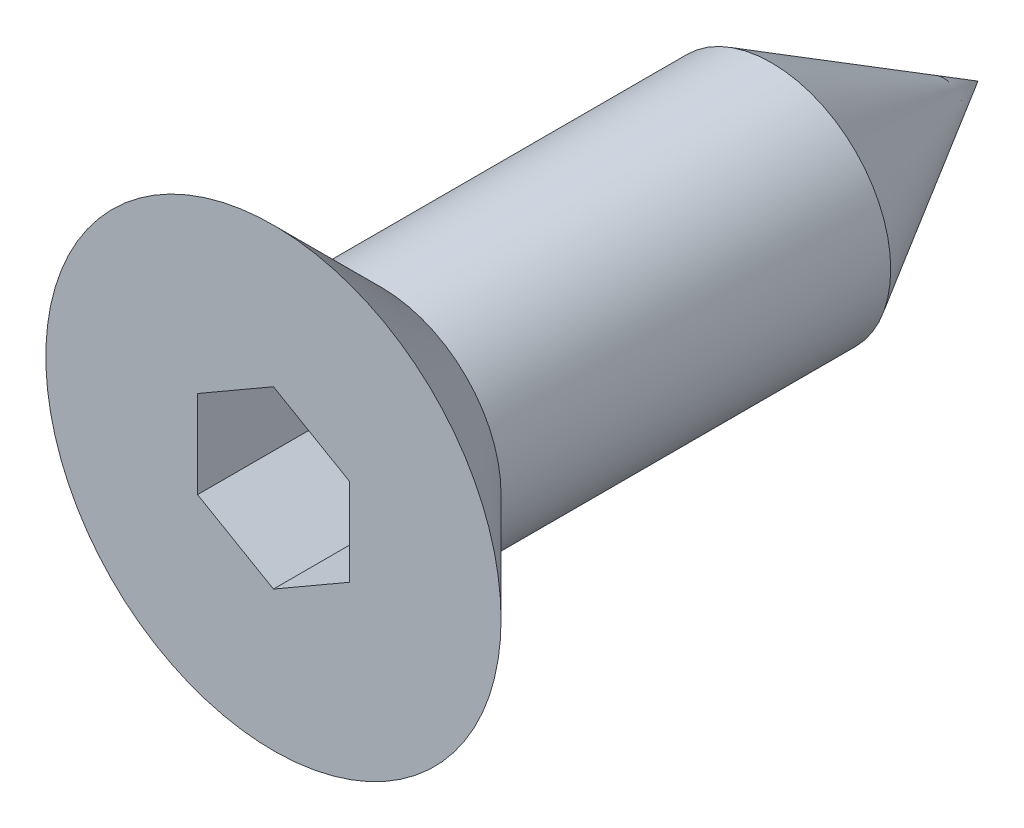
ISO-10303-21;
HEADER;
FILE_DESCRIPTION(('STEP AP214'),'2;1');
FILE_NAME('part.step','',(''),(''),'','','');
FILE_SCHEMA(('AUTOMOTIVE_DESIGN { 1 0 10303 214 1 1 1 1 }'));
ENDSEC;
DATA;
#1=APPLICATION_CONTEXT('core data for automotive mechanical design processes');
#2=APPLICATION_PROTOCOL_DEFINITION('international standard','automotive_design',2000,#1);
#3=PRODUCT_CONTEXT('',#1,'mechanical');
#4=PRODUCT('Part','Part','',(#3));
#5=PRODUCT_RELATED_PRODUCT_CATEGORY('part','',(#4));
#6=PRODUCT_DEFINITION_FORMATION('','',#4);
#7=PRODUCT_DEFINITION_CONTEXT('part definition',#1,'design');
#8=PRODUCT_DEFINITION('design','',#6,#7);
#9=PRODUCT_DEFINITION_SHAPE('','',#8);
#10=(LENGTH_UNIT() NAMED_UNIT(*) SI_UNIT(.MILLI.,.METRE.));
#11=(NAMED_UNIT(*) PLANE_ANGLE_UNIT() SI_UNIT($,.RADIAN.));
#12=(NAMED_UNIT(*) SI_UNIT($,.STERADIAN.) SOLID_ANGLE_UNIT());
#13=UNCERTAINTY_MEASURE_WITH_UNIT(LENGTH_MEASURE(1.E-05),#10,'distance_accuracy_value','');
#14=(GEOMETRIC_REPRESENTATION_CONTEXT(3) GLOBAL_UNCERTAINTY_ASSIGNED_CONTEXT((#13)) GLOBAL_UNIT_ASSIGNED_CONTEXT((#10,
#11,#12)) REPRESENTATION_CONTEXT('',''));
#15=CARTESIAN_POINT('',(0.,0.,0.));
#16=DIRECTION('',(0.,0.,1.));
#17=DIRECTION('',(1.,0.,0.));
#18=AXIS2_PLACEMENT_3D('',#15,#16,#17);
#19=CARTESIAN_POINT('',(0.,2.1,0.));
#20=DIRECTION('',(0.,0.,-1.));
#21=DIRECTION('',(-1.,0.,0.));
#22=AXIS2_PLACEMENT_3D('',#19,#20,#21);
#23=PLANE('',#22);
#24=DIRECTION('',(-0.866025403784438,-0.5,0.));
#25=VECTOR('',#24,1.);
#26=CARTESIAN_POINT('',(0.,0.808290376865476,0.));
#27=LINE('',#26,#25);
#28=CARTESIAN_POINT('',(0.,0.808290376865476,0.));
#29=VERTEX_POINT('',#28);
#30=CARTESIAN_POINT('',(-0.7,0.404145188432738,0.));
#31=VERTEX_POINT('',#30);
#32=EDGE_CURVE('E123',#29,#31,#27,.T.);
#33=ORIENTED_EDGE('',*,*,#32,.F.);
#34=DIRECTION('',(-0.866025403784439,0.5,0.));
#35=VECTOR('',#34,1.);
#36=CARTESIAN_POINT('',(0.699999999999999,0.404145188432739,0.));
#37=LINE('',#36,#35);
#38=CARTESIAN_POINT('',(0.699999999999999,0.404145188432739,0.));
#39=VERTEX_POINT('',#38);
#40=EDGE_CURVE('E53',#39,#29,#37,.T.);
#41=ORIENTED_EDGE('',*,*,#40,.F.);
#42=DIRECTION('',(0.,1.,0.));
#43=VECTOR('',#42,1.);
#44=CARTESIAN_POINT('',(0.7,-0.404145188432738,0.));
#45=LINE('',#44,#43);
#46=CARTESIAN_POINT('',(0.7,-0.404145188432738,0.));
#47=VERTEX_POINT('',#46);
#48=EDGE_CURVE('E109',#47,#39,#45,.T.);
#49=ORIENTED_EDGE('',*,*,#48,.F.);
#50=DIRECTION('',(0.866025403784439,0.5,0.));
#51=VECTOR('',#50,1.);
#52=CARTESIAN_POINT('',(0.,-0.808290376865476,0.));
#53=LINE('',#52,#51);
#54=CARTESIAN_POINT('',(0.,-0.808290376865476,0.));
#55=VERTEX_POINT('',#54);
#56=EDGE_CURVE('E112',#55,#47,#53,.T.);
#57=ORIENTED_EDGE('',*,*,#56,.F.);
#58=DIRECTION('',(0.866025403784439,-0.5,0.));
#59=VECTOR('',#58,1.);
#60=CARTESIAN_POINT('',(-0.7,-0.404145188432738,0.));
#61=LINE('',#60,#59);
#62=CARTESIAN_POINT('',(-0.7,-0.404145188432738,0.));
#63=VERTEX_POINT('',#62);
#64=EDGE_CURVE('E128',#63,#55,#61,.T.);
#65=ORIENTED_EDGE('',*,*,#64,.F.);
#66=DIRECTION('',(0.,-1.,0.));
#67=VECTOR('',#66,1.);
#68=CARTESIAN_POINT('',(-0.7,0.404145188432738,0.));
#69=LINE('',#68,#67);
#70=EDGE_CURVE('E125',#31,#63,#69,.T.);
#71=ORIENTED_EDGE('',*,*,#70,.F.);
#72=EDGE_LOOP('',(#33,#41,#49,#57,#65,#71));
#73=FACE_BOUND('',#72,.T.);
#74=CARTESIAN_POINT('',(0.,0.,0.));
#75=DIRECTION('',(0.,0.,1.));
#76=DIRECTION('',(1.,0.,0.));
#77=AXIS2_PLACEMENT_3D('',#74,#75,#76);
#78=CIRCLE('',#77,2.1);
#79=CARTESIAN_POINT('',(2.1,0.,0.));
#80=VERTEX_POINT('',#79);
#81=EDGE_CURVE('E46',#80,#80,#78,.T.);
#82=ORIENTED_EDGE('',*,*,#81,.T.);
#83=EDGE_LOOP('',(#82));
#84=FACE_BOUND('',#83,.T.);
#85=ADVANCED_FACE('F37',(#73,#84),#23,.F.);
#86=CARTESIAN_POINT('',(0.,0.,-1.));
#87=DIRECTION('',(0.,0.,1.));
#88=DIRECTION('',(1.,0.,0.));
#89=AXIS2_PLACEMENT_3D('',#86,#87,#88);
#90=CONICAL_SURFACE('',#89,1.1,0.785398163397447);
#91=ORIENTED_EDGE('',*,*,#81,.F.);
#92=EDGE_LOOP('',(#91));
#93=FACE_BOUND('',#92,.T.);
#94=CARTESIAN_POINT('',(0.,0.,-1.));
#95=DIRECTION('',(0.,0.,1.));
#96=DIRECTION('',(1.,0.,0.));
#97=AXIS2_PLACEMENT_3D('',#94,#95,#96);
#98=CIRCLE('',#97,1.1);
#99=CARTESIAN_POINT('',(1.1,0.,-1.));
#100=VERTEX_POINT('',#99);
#101=EDGE_CURVE('E135',#100,#100,#98,.T.);
#102=ORIENTED_EDGE('',*,*,#101,.T.);
#103=EDGE_LOOP('',(#102));
#104=FACE_BOUND('',#103,.T.);
#105=ADVANCED_FACE('F148',(#93,#104),#90,.T.);
#106=CARTESIAN_POINT('',(0.,0.,-6.5));
#107=DIRECTION('',(0.,0.,1.));
#108=DIRECTION('',(1.,0.,0.));
#109=AXIS2_PLACEMENT_3D('',#106,#107,#108);
#110=CYLINDRICAL_SURFACE('',#109,1.1);
#111=CARTESIAN_POINT('',(0.,0.,-4.59474411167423));
#112=DIRECTION('',(0.,0.,1.));
#113=DIRECTION('',(1.,0.,0.));
#114=AXIS2_PLACEMENT_3D('',#111,#112,#113);
#115=CIRCLE('',#114,1.1);
#116=CARTESIAN_POINT('',(1.1,0.,-4.59474411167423));
#117=VERTEX_POINT('',#116);
#118=EDGE_CURVE('E11',#117,#117,#115,.T.);
#119=CARTESIAN_POINT('',(1.1,0.,-4.59474411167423));
#120=CARTESIAN_POINT('',(1.1,0.,-4.55729886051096));
#121=CARTESIAN_POINT('',(1.1,0.,-4.51985360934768));
#122=CARTESIAN_POINT('',(1.1,0.,-4.44496310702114));
#123=CARTESIAN_POINT('',(1.1,0.,-4.40751785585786));
#124=CARTESIAN_POINT('',(1.1,0.,-4.33262735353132));
#125=CARTESIAN_POINT('',(1.1,0.,-4.29518210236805));
#126=CARTESIAN_POINT('',(1.1,0.,-4.2202916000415));
#127=CARTESIAN_POINT('',(1.1,0.,-4.18284634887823));
#128=CARTESIAN_POINT('',(1.1,0.,-4.10795584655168));
#129=CARTESIAN_POINT('',(1.1,0.,-4.07051059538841));
#130=CARTESIAN_POINT('',(1.1,0.,-3.99562009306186));
#131=CARTESIAN_POINT('',(1.1,0.,-3.95817484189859));
#132=CARTESIAN_POINT('',(1.1,0.,-3.88328433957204));
#133=CARTESIAN_POINT('',(1.1,0.,-3.84583908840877));
#134=CARTESIAN_POINT('',(1.1,0.,-3.77094858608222));
#135=CARTESIAN_POINT('',(1.1,0.,-3.73350333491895));
#136=CARTESIAN_POINT('',(1.1,0.,-3.6586128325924));
#137=CARTESIAN_POINT('',(1.1,0.,-3.62116758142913));
#138=CARTESIAN_POINT('',(1.1,0.,-3.54627707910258));
#139=CARTESIAN_POINT('',(1.1,0.,-3.50883182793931));
#140=CARTESIAN_POINT('',(1.1,0.,-3.43394132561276));
#141=CARTESIAN_POINT('',(1.1,0.,-3.39649607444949));
#142=CARTESIAN_POINT('',(1.1,0.,-3.32160557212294));
#143=CARTESIAN_POINT('',(1.1,0.,-3.28416032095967));
#144=CARTESIAN_POINT('',(1.1,0.,-3.20926981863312));
#145=CARTESIAN_POINT('',(1.1,0.,-3.17182456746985));
#146=CARTESIAN_POINT('',(1.1,0.,-3.0969340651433));
#147=CARTESIAN_POINT('',(1.1,0.,-3.05948881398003));
#148=CARTESIAN_POINT('',(1.1,0.,-2.98459831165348));
#149=CARTESIAN_POINT('',(1.1,0.,-2.94715306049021));
#150=CARTESIAN_POINT('',(1.1,0.,-2.87226255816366));
#151=CARTESIAN_POINT('',(1.1,0.,-2.83481730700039));
#152=CARTESIAN_POINT('',(1.1,0.,-2.75992680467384));
#153=CARTESIAN_POINT('',(1.1,0.,-2.72248155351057));
#154=CARTESIAN_POINT('',(1.1,0.,-2.64759105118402));
#155=CARTESIAN_POINT('',(1.1,0.,-2.61014580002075));
#156=CARTESIAN_POINT('',(1.1,0.,-2.5352552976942));
#157=CARTESIAN_POINT('',(1.1,0.,-2.49781004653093));
#158=CARTESIAN_POINT('',(1.1,0.,-2.42291954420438));
#159=CARTESIAN_POINT('',(1.1,0.,-2.38547429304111));
#160=CARTESIAN_POINT('',(1.1,0.,-2.31058379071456));
#161=CARTESIAN_POINT('',(1.1,0.,-2.27313853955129));
#162=CARTESIAN_POINT('',(1.1,0.,-2.19824803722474));
#163=CARTESIAN_POINT('',(1.1,0.,-2.16080278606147));
#164=CARTESIAN_POINT('',(1.1,0.,-2.08591228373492));
#165=CARTESIAN_POINT('',(1.1,0.,-2.04846703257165));
#166=CARTESIAN_POINT('',(1.1,0.,-1.97357653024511));
#167=CARTESIAN_POINT('',(1.1,0.,-1.93613127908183));
#168=CARTESIAN_POINT('',(1.1,0.,-1.86124077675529));
#169=CARTESIAN_POINT('',(1.1,0.,-1.82379552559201));
#170=CARTESIAN_POINT('',(1.1,0.,-1.74890502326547));
#171=CARTESIAN_POINT('',(1.1,0.,-1.71145977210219));
#172=CARTESIAN_POINT('',(1.1,0.,-1.63656926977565));
#173=CARTESIAN_POINT('',(1.1,0.,-1.59912401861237));
#174=CARTESIAN_POINT('',(1.1,0.,-1.52423351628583));
#175=CARTESIAN_POINT('',(1.1,0.,-1.48678826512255));
#176=CARTESIAN_POINT('',(1.1,0.,-1.41189776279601));
#177=CARTESIAN_POINT('',(1.1,0.,-1.37445251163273));
#178=CARTESIAN_POINT('',(1.1,0.,-1.29956200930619));
#179=CARTESIAN_POINT('',(1.1,0.,-1.26211675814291));
#180=CARTESIAN_POINT('',(1.1,0.,-1.18722625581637));
#181=CARTESIAN_POINT('',(1.1,0.,-1.14978100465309));
#182=CARTESIAN_POINT('',(1.1,0.,-1.07489050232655));
#183=CARTESIAN_POINT('',(1.1,0.,-1.03744525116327));
#184=CARTESIAN_POINT('',(1.1,0.,-1.));
#185=B_SPLINE_CURVE_WITH_KNOTS('',3,(#119,#120,#121,#122,#123,#124,#125,#126,#127,#128,#129,
#130,#131,#132,#133,#134,#135,#136,#137,#138,#139,#140,#141,#142,#143,#144,#145,#146,#147,#148,
#149,#150,#151,#152,#153,#154,#155,#156,#157,#158,#159,#160,#161,#162,#163,#164,#165,#166,#167,
#168,#169,#170,#171,#172,#173,#174,#175,#176,#177,#178,#179,#180,#181,#182,#183,#184),
.UNSPECIFIED.,.F.,.F.,(4,2,2,2,2,2,2,2,2,2,2,2,2,2,2,2,2,2,2,2,2,2,2,2,2,2,2,2,2,2,2,2,4),(0.,
0.11233575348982,0.224671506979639,0.337007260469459,0.449343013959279,0.561678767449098,
0.674014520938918,0.786350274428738,0.898686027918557,1.01102178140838,1.1233575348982,
1.23569328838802,1.34802904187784,1.46036479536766,1.57270054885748,1.6850363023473,
1.79737205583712,1.90970780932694,2.02204356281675,2.13437931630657,2.24671506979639,
2.35905082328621,2.47138657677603,2.58372233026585,2.69605808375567,2.80839383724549,
2.92072959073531,3.03306534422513,3.14540109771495,3.25773685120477,3.37007260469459,
3.48240835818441,3.59474411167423),.UNSPECIFIED.);
#186=EDGE_CURVE('BSEAM151',#117,#100,#185,.T.);
#187=ORIENTED_EDGE('',*,*,#118,.T.);
#188=ORIENTED_EDGE('',*,*,#101,.F.);
#189=ORIENTED_EDGE('',*,*,#186,.T.);
#190=ORIENTED_EDGE('',*,*,#186,.F.);
#191=EDGE_LOOP('',(#187,#189,#188,#190));
#192=FACE_BOUND('',#191,.T.);
#193=ADVANCED_FACE('F151',(#192),#110,.T.);
#194=CARTESIAN_POINT('',(0.699999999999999,0.404145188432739,-1.5));
#195=DIRECTION('',(0.5,0.866025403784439,0.));
#196=DIRECTION('',(-0.866025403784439,0.5,0.));
#197=AXIS2_PLACEMENT_3D('',#194,#195,#196);
#198=PLANE('',#197);
#199=ORIENTED_EDGE('',*,*,#40,.T.);
#200=DIRECTION('',(0.,0.,1.));
#201=VECTOR('',#200,1.);
#202=CARTESIAN_POINT('',(0.,0.808290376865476,-1.5));
#203=LINE('',#202,#201);
#204=CARTESIAN_POINT('',(0.,0.808290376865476,-1.5));
#205=VERTEX_POINT('',#204);
#206=EDGE_CURVE('E86',#205,#29,#203,.T.);
#207=ORIENTED_EDGE('',*,*,#206,.F.);
#208=DIRECTION('',(-0.866025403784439,0.5,0.));
#209=VECTOR('',#208,1.);
#210=CARTESIAN_POINT('',(0.699999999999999,0.404145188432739,-1.5));
#211=LINE('',#210,#209);
#212=CARTESIAN_POINT('',(0.699999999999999,0.404145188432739,-1.5));
#213=VERTEX_POINT('',#212);
#214=EDGE_CURVE('E90',#213,#205,#211,.T.);
#215=ORIENTED_EDGE('',*,*,#214,.F.);
#216=DIRECTION('',(0.,0.,1.));
#217=VECTOR('',#216,1.);
#218=CARTESIAN_POINT('',(0.699999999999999,0.404145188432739,-1.5));
#219=LINE('',#218,#217);
#220=EDGE_CURVE('E133',#213,#39,#219,.T.);
#221=ORIENTED_EDGE('',*,*,#220,.T.);
#222=EDGE_LOOP('',(#199,#207,#215,#221));
#223=FACE_BOUND('',#222,.T.);
#224=ADVANCED_FACE('F88',(#223),#198,.F.);
#225=CARTESIAN_POINT('',(0.7,-0.404145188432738,-1.5));
#226=DIRECTION('',(1.,0.,0.));
#227=DIRECTION('',(0.,1.,0.));
#228=AXIS2_PLACEMENT_3D('',#225,#226,#227);
#229=PLANE('',#228);
#230=ORIENTED_EDGE('',*,*,#48,.T.);
#231=ORIENTED_EDGE('',*,*,#220,.F.);
#232=DIRECTION('',(0.,1.,0.));
#233=VECTOR('',#232,1.);
#234=CARTESIAN_POINT('',(0.7,-0.404145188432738,-1.5));
#235=LINE('',#234,#233);
#236=CARTESIAN_POINT('',(0.7,-0.404145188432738,-1.5));
#237=VERTEX_POINT('',#236);
#238=EDGE_CURVE('E96',#237,#213,#235,.T.);
#239=ORIENTED_EDGE('',*,*,#238,.F.);
#240=DIRECTION('',(0.,0.,1.));
#241=VECTOR('',#240,1.);
#242=CARTESIAN_POINT('',(0.7,-0.404145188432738,-1.5));
#243=LINE('',#242,#241);
#244=EDGE_CURVE('E136',#237,#47,#243,.T.);
#245=ORIENTED_EDGE('',*,*,#244,.T.);
#246=EDGE_LOOP('',(#230,#231,#239,#245));
#247=FACE_BOUND('',#246,.T.);
#248=ADVANCED_FACE('F161',(#247),#229,.F.);
#249=CARTESIAN_POINT('',(0.,-0.808290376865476,-1.5));
#250=DIRECTION('',(0.5,-0.866025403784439,0.));
#251=DIRECTION('',(0.866025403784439,0.5,0.));
#252=AXIS2_PLACEMENT_3D('',#249,#250,#251);
#253=PLANE('',#252);
#254=ORIENTED_EDGE('',*,*,#56,.T.);
#255=ORIENTED_EDGE('',*,*,#244,.F.);
#256=DIRECTION('',(0.866025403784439,0.5,0.));
#257=VECTOR('',#256,1.);
#258=CARTESIAN_POINT('',(0.,-0.808290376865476,-1.5));
#259=LINE('',#258,#257);
#260=CARTESIAN_POINT('',(0.,-0.808290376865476,-1.5));
#261=VERTEX_POINT('',#260);
#262=EDGE_CURVE('E119',#261,#237,#259,.T.);
#263=ORIENTED_EDGE('',*,*,#262,.F.);
#264=DIRECTION('',(0.,0.,1.));
#265=VECTOR('',#264,1.);
#266=CARTESIAN_POINT('',(0.,-0.808290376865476,-1.5));
#267=LINE('',#266,#265);
#268=EDGE_CURVE('E138',#261,#55,#267,.T.);
#269=ORIENTED_EDGE('',*,*,#268,.T.);
#270=EDGE_LOOP('',(#254,#255,#263,#269));
#271=FACE_BOUND('',#270,.T.);
#272=ADVANCED_FACE('F178',(#271),#253,.F.);
#273=CARTESIAN_POINT('',(-0.7,-0.404145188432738,-1.5));
#274=DIRECTION('',(-0.5,-0.866025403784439,0.));
#275=DIRECTION('',(0.866025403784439,-0.5,0.));
#276=AXIS2_PLACEMENT_3D('',#273,#274,#275);
#277=PLANE('',#276);
#278=ORIENTED_EDGE('',*,*,#64,.T.);
#279=ORIENTED_EDGE('',*,*,#268,.F.);
#280=DIRECTION('',(0.866025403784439,-0.5,0.));
#281=VECTOR('',#280,1.);
#282=CARTESIAN_POINT('',(-0.7,-0.404145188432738,-1.5));
#283=LINE('',#282,#281);
#284=CARTESIAN_POINT('',(-0.7,-0.404145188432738,-1.5));
#285=VERTEX_POINT('',#284);
#286=EDGE_CURVE('E116',#285,#261,#283,.T.);
#287=ORIENTED_EDGE('',*,*,#286,.F.);
#288=DIRECTION('',(0.,0.,1.));
#289=VECTOR('',#288,1.);
#290=CARTESIAN_POINT('',(-0.7,-0.404145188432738,-1.5));
#291=LINE('',#290,#289);
#292=EDGE_CURVE('E140',#285,#63,#291,.T.);
#293=ORIENTED_EDGE('',*,*,#292,.T.);
#294=EDGE_LOOP('',(#278,#279,#287,#293));
#295=FACE_BOUND('',#294,.T.);
#296=ADVANCED_FACE('F176',(#295),#277,.F.);
#297=CARTESIAN_POINT('',(-0.7,0.404145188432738,-1.5));
#298=DIRECTION('',(-1.,0.,0.));
#299=DIRECTION('',(0.,-1.,0.));
#300=AXIS2_PLACEMENT_3D('',#297,#298,#299);
#301=PLANE('',#300);
#302=ORIENTED_EDGE('',*,*,#70,.T.);
#303=ORIENTED_EDGE('',*,*,#292,.F.);
#304=DIRECTION('',(0.,-1.,0.));
#305=VECTOR('',#304,1.);
#306=CARTESIAN_POINT('',(-0.7,0.404145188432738,-1.5));
#307=LINE('',#306,#305);
#308=CARTESIAN_POINT('',(-0.7,0.404145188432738,-1.5));
#309=VERTEX_POINT('',#308);
#310=EDGE_CURVE('E104',#309,#285,#307,.T.);
#311=ORIENTED_EDGE('',*,*,#310,.F.);
#312=DIRECTION('',(0.,0.,1.));
#313=VECTOR('',#312,1.);
#314=CARTESIAN_POINT('',(-0.7,0.404145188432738,-1.5));
#315=LINE('',#314,#313);
#316=EDGE_CURVE('E95',#309,#31,#315,.T.);
#317=ORIENTED_EDGE('',*,*,#316,.T.);
#318=EDGE_LOOP('',(#302,#303,#311,#317));
#319=FACE_BOUND('',#318,.T.);
#320=ADVANCED_FACE('F172',(#319),#301,.F.);
#321=CARTESIAN_POINT('',(0.,0.808290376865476,-1.5));
#322=DIRECTION('',(-0.5,0.866025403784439,0.));
#323=DIRECTION('',(-0.866025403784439,-0.5,0.));
#324=AXIS2_PLACEMENT_3D('',#321,#322,#323);
#325=PLANE('',#324);
#326=ORIENTED_EDGE('',*,*,#32,.T.);
#327=ORIENTED_EDGE('',*,*,#316,.F.);
#328=DIRECTION('',(-0.866025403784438,-0.5,0.));
#329=VECTOR('',#328,1.);
#330=CARTESIAN_POINT('',(0.,0.808290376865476,-1.5));
#331=LINE('',#330,#329);
#332=EDGE_CURVE('E99',#205,#309,#331,.T.);
#333=ORIENTED_EDGE('',*,*,#332,.F.);
#334=ORIENTED_EDGE('',*,*,#206,.T.);
#335=EDGE_LOOP('',(#326,#327,#333,#334));
#336=FACE_BOUND('',#335,.T.);
#337=ADVANCED_FACE('F100',(#336),#325,.F.);
#338=CARTESIAN_POINT('',(0.,0.808290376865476,-1.5));
#339=DIRECTION('',(0.,0.,1.));
#340=DIRECTION('',(1.,0.,0.));
#341=AXIS2_PLACEMENT_3D('',#338,#339,#340);
#342=PLANE('',#341);
#343=ORIENTED_EDGE('',*,*,#214,.T.);
#344=ORIENTED_EDGE('',*,*,#332,.T.);
#345=ORIENTED_EDGE('',*,*,#310,.T.);
#346=ORIENTED_EDGE('',*,*,#286,.T.);
#347=ORIENTED_EDGE('',*,*,#262,.T.);
#348=ORIENTED_EDGE('',*,*,#238,.T.);
#349=EDGE_LOOP('',(#343,#344,#345,#346,#347,#348));
#350=FACE_BOUND('',#349,.T.);
#351=ADVANCED_FACE('F106',(#350),#342,.T.);
#352=CARTESIAN_POINT('',(0.,0.,-4.59474411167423));
#353=DIRECTION('',(0.,0.,1.));
#354=DIRECTION('',(1.,0.,0.));
#355=AXIS2_PLACEMENT_3D('',#352,#353,#354);
#356=CONICAL_SURFACE('',#355,1.1,0.5235987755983);
#357=CARTESIAN_POINT('',(0.,0.,-6.5));
#358=VERTEX_POINT('',#357);
#359=VERTEX_LOOP('',#358);
#360=FACE_BOUND('',#359,.T.);
#361=ORIENTED_EDGE('',*,*,#118,.F.);
#362=EDGE_LOOP('',(#361));
#363=FACE_BOUND('',#362,.T.);
#364=ADVANCED_FACE('F39',(#360,#363),#356,.T.);
#365=CLOSED_SHELL('',(#85,#105,#193,#224,#248,#272,#296,#320,#337,#351,#364));
#366=MANIFOLD_SOLID_BREP('B2',#365);
#367=ADVANCED_BREP_SHAPE_REPRESENTATION('',(#18,#366),#14);
#368=SHAPE_DEFINITION_REPRESENTATION(#9,#367);
ENDSEC;
END-ISO-10303-21;
